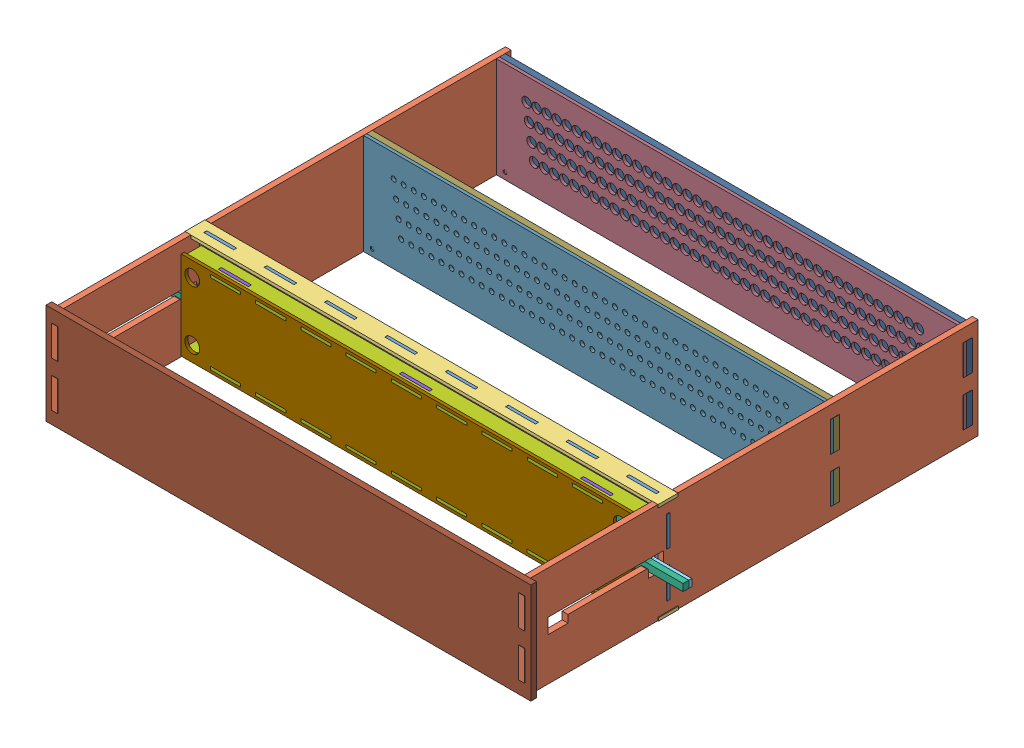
SolidWorks assembly Ensamblaje telar.SLDASM, configuration Predeterminado (file format 11000). Lengths in mm.
Overall size (527.2 100.2 451).
20 component instances, 15 part files, 57 mates.
Components (placement in the parent):
- placa principal-1: placa principal.SLDPRT [Predeterminado] at (25.0659 -19.802 468.9) size (470.4 100 3)
- pared-1: pared.SLDPRT [Predeterminado] at (-209.8341 -19.602 384.8) x (0 1 0) z (1 0 0) size (100 451 5.7)
- pared-2: pared.SLDPRT [Predeterminado] at (254.2659 -19.602 384.8) x (0 1 0) z (1 0 0) size (100 451 5.7)
- refuerzo placa principal-1: refuerzo placa principal.SLDPRT [Predeterminado] at (25.3659 -66.802 470.5) x (1 0 0) z (0 -1 0) size (470.4 20 3)
- refuerzo placa principal-2: refuerzo placa principal.SLDPRT [Predeterminado] at (24.7659 30.198 470.5) x (1 0 0) z (0 -1 0) size (470.4 20 3)
- 160 Seguros dos-1: 160 Seguros dos.SLDPRT [Predeterminado] at (249.0659 -63.802 472.5357) x (0 1 0) z (1 0 0) size (88 3 448)
- marco bloqueo inferior-2: marco bloqueo inferior.SLDPRT [Predeterminado] at (230.6659 -58.1922 475.5357) x (0 1 0) z (1 0 0) size (66.5 3 527.2)
- marco bloqueo superior-2: marco bloqueo superior.SLDPRT [Predeterminado] at (230.6659 -58.1922 478.5357) x (0 1 0) z (1 0 0) size (66.5 5.7 527.2)
- pared caja-1: pared caja.SLDPRT [Predeterminado] at (25.0659 -58.002 484.0357) x (1 0 0) z (0 -1 0) size (448 23 3)
- pared caja-2: pared caja.SLDPRT [Predeterminado] at (25.0659 21.398 484.0357) x (1 0 0) z (0 -1 0) size (448 23 3)
- deslizador-1: deslizador.SLDPRT [Predeterminado] at (-155.0341 -19.802 484.5357) size (36 82.4 3)
- deslizador-2: deslizador.SLDPRT [Predeterminado] at (24.9659 -19.802 484.5357) size (36 82.4 3)
- deslizador-3: deslizador.SLDPRT [Predeterminado] at (204.9659 -19.802 484.5357) size (36 82.4 3)
- tapa caja-1: tapa caja.SLDPRT [Predeterminado] at (25.0659 -19.802 492.5357) size (448 88 3) (hidden)
- base-1: base.SLDPRT [Predeterminado] at (25.0659 -19.602 168.3) size (470.4 100 5.7)
- tapa-1: tapa.SLDPRT [Predeterminado] at (25.1659 -19.602 607.3) size (482 100 5.7)
- guias-1: guias.SLDPRT [Predeterminado] at (25.0659 -19.602 300.4) size (470.4 100 5.7)
- guia inferior-1: guia inferior.SLDPRT [Predeterminado] at (25.0659 -19.602 174) size (470.4 100 3)
- guia superior-1: guia superior.SLDPRT [Predeterminado] at (25.0659 -19.602 306.1) size (470.4 100 3)
- Guia rodamientos-1: Guia rodamientos.SLDPRT [Predeterminado] at (-178.9341 -52.802 604.3) x (0 1 0) z (1 0 0) size (90 3 470.4)
Mates (geometry in assembly coordinates):
- Coincidente1: coincident: plane of placa principal-1 through (25.0659 -19.802 471.9) normal (0 0 1); plane of pared-1 through (-209.8351 -27.102 471.9) normal (0 0 -1)
- Coincidente2: coincident: plane of placa principal-1 through (-204.1341 -69.802 471.9) normal (-1 0 0); plane of pared-1 through (-204.1341 -19.602 384.8) normal (1 0 0)
- Coincidente3: coincident: plane of placa principal-1 through (-210.1341 -57.102 471.9) normal (0 -1 0); plane of pared-1 through (-209.8351 -57.102 471.9) normal (0 1 0)
- Coincidente4: coincident: plane of placa principal-1 through (254.2659 -69.802 471.9) normal (1 0 0); plane of pared-2 through (254.2659 -19.602 384.8) normal (-1 0 0)
- Coincidente5: coincident: plane of placa principal-1 through (25.0659 -19.802 471.9) normal (0 0 1); plane of pared-2 through (254.2649 -12.102 471.9) normal (0 0 -1)
- Coincidente6: coincident: plane of placa principal-1 through (260.2659 -57.102 471.9) normal (0 -1 0); plane of pared-2 through (254.2649 -57.102 471.9) normal (0 1 0)
- Coincidente7: coincident: plane of placa principal-1 through (25.0659 -19.802 471.9) normal (0 0 1); plane of refuerzo placa principal-1 through (-79.5341 -69.802 471.9) normal (0 0 -1)
- Coincidente9: coincident: plane of placa principal-1 through (25.0659 -66.802 468.9) normal (0 -1 0); plane of refuerzo placa principal-1 through (25.3659 -66.802 470.5) normal (0 1 0)
- Coincidente10: coincident: plane of placa principal-1 through (25.0659 -19.802 471.9) normal (0 0 1); plane of refuerzo placa principal-2 through (99.8659 27.198 471.9) normal (0 0 -1)
- Coincidente12: coincident: plane of placa principal-1 through (25.0659 27.198 468.9) normal (0 1 0); plane of refuerzo placa principal-2 through (24.7659 27.198 470.5) normal (0 -1 0)
- Concéntrica1: concentric: circle of placa principal-1; cylinder of 160 Seguros dos-1 through (-187.9341 9.198 475.5357) axis (0 0 -1) radius 7.4
- Concéntrica2: concentric: circle of placa principal-1; circle of 160 Seguros dos-1
- Concéntrica5: concentric: circle of placa principal-1; circle of 160 Seguros dos-1
- Coincidente13: coincident: plane of marco bloqueo inferior-2 through (-238.5341 -28.4422 478.5357) normal (-1 0 0); plane of marco bloqueo superior-2 through (-238.5341 -28.4422 484.2357) normal (-1 0 0)
- Coincidente14: coincident: plane of marco bloqueo inferior-2 through (223.3659 -56.3922 478.5357) normal (0 0 1); plane of marco bloqueo superior-2 through (223.3659 -56.3922 478.5357) normal (0 0 -1)
- Coincidente15: coincident: plane of marco bloqueo inferior-2 through (-198.5341 -28.4422 478.5357) normal (0 -1 0); plane of marco bloqueo superior-2 through (-198.5341 -28.4422 484.2357) normal (0 -1 0)
- Tangente1: tangent: circle of 160 Seguros dos-1; plane of marco bloqueo superior-2 through (-180.5341 -7.2922 484.2357) normal (-1 0 0)
- Tangente2: tangent: cylinder of 160 Seguros dos-1 through (238.0659 9.198 475.5357) axis (0 0 -1) radius 7.4; plane of marco bloqueo superior-2 through (230.6659 -7.2922 484.2357) normal (1 0 0)
- Coincidente16: coincident: plane of 160 Seguros dos-1 through (249.0659 -63.802 475.5357) normal (0 0 1); plane of marco bloqueo inferior-2 through (223.3659 -56.3922 475.5357) normal (0 0 -1)
- Coincidente18: coincident: plane of 160 Seguros dos-1 through (-198.9341 -63.802 475.5357) normal (-1 0 0); plane of pared caja-1 through (-198.9341 -61.002 475.5357) normal (-1 0 0)
- Coincidente19: coincident: plane of 160 Seguros dos-1 through (249.0659 -63.802 475.5357) normal (0 0 1); plane of pared caja-1 through (-198.9341 -61.002 475.5357) normal (0 0 -1)
- Coincidente21: coincident: plane of 160 Seguros dos-1 through (-198.9341 -63.802 475.5357) normal (-1 0 0); plane of pared caja-2 through (-198.9341 18.398 475.5357) normal (-1 0 0)
- Coincidente22: coincident: plane of 160 Seguros dos-1 through (249.0659 -63.802 475.5357) normal (0 0 1); plane of pared caja-2 through (-198.9341 18.398 475.5357) normal (0 0 -1)
- Coincidente23: coincident: plane of pared caja-1 through (25.0659 -58.002 484.0357) normal (0 1 0); plane of deslizador-1 through (-173.0341 -58.002 487.5357) normal (0 -1 0)
- Coincidente24: coincident: plane of pared caja-1 through (-140.0341 -61.003 484.5357) normal (-1 0 0); plane of deslizador-1 through (-140.0341 -61.002 487.5357) normal (1 0 0)
- Coincidente25: coincident: plane of pared caja-1 through (-140.0341 -61.003 484.5357) normal (0 0 1); plane of deslizador-1 through (-155.0341 -19.802 484.5357) normal (0 0 -1)
- Coincidente26: coincident: plane of pared caja-1 through (39.9659 -61.003 484.5357) normal (-1 0 0); plane of deslizador-2 through (39.9659 -61.002 487.5357) normal (1 0 0)
- Coincidente27: coincident: plane of pared caja-1 through (25.0659 -58.002 484.0357) normal (0 1 0); plane of deslizador-2 through (6.9659 -58.002 487.5357) normal (0 -1 0)
- Coincidente28: coincident: plane of pared caja-1 through (39.9659 -61.003 484.5357) normal (0 0 1); plane of deslizador-2 through (24.9659 -19.802 484.5357) normal (0 0 -1)
- Coincidente29: coincident: plane of pared caja-1 through (219.9659 -61.003 487.3357) normal (-1 0 0); plane of deslizador-3 through (219.9659 -61.002 487.5357) normal (1 0 0)
- Coincidente30: coincident: plane of pared caja-1 through (25.0659 -58.002 484.0357) normal (0 1 0); plane of deslizador-3 through (186.9659 -58.002 487.5357) normal (0 -1 0)
- Coincidente31: coincident: plane of pared caja-1 through (219.9659 -61.003 484.5357) normal (0 0 1); plane of deslizador-3 through (204.9659 -19.802 484.5357) normal (0 0 -1)
- Concéntrica6: concentric: circle of 160 Seguros dos-1; circle of tapa caja-1
- Concéntrica7: concentric: circle of 160 Seguros dos-1; circle of tapa caja-1
- Coincidente32: coincident: plane of pared caja-1 through (-198.9341 -61.002 492.5357) normal (0 0 1); plane of tapa caja-1 through (25.0659 -19.802 492.5357) normal (0 0 -1)
- Coincidente33: coincident: line of 160 Seguros dos-1 through (-5.0341 -58.002 475.5357) axis (-1 0 0); plane of pared caja-1 through (25.0659 -58.002 484.0357) normal (0 1 0)
- Coincidente34: coincident: plane of 160 Seguros dos-1 through (-50.0341 18.398 472.5347) normal (0 1 0); plane of pared caja-2 through (25.0659 18.398 484.0357) normal (0 -1 0)
- Coincidente35: coincident: plane of pared-1 through (-204.1341 -69.602 162.3) normal (0 -1 0); plane of base-1 through (-204.1341 -69.602 174) normal (0 -1 0)
- Coincidente36: coincident: plane of pared-1 through (-204.1341 -19.602 384.8) normal (1 0 0); plane of base-1 through (-204.1341 -69.602 174) normal (-1 0 0)
- Coincidente39: coincident: plane of pared-1 through (-204.1341 -69.602 162.3) normal (0 -1 0); plane of tapa-1 through (-215.8341 -69.602 613) normal (0 -1 0)
- Coincidente40: coincident: plane of pared-1 through (-204.1341 -19.602 384.8) normal (1 0 0); line of tapa-1 through (-204.1341 -57.002 607.3) axis (0 1 0)
- Coincidente41: coincident: plane of pared-1 through (-204.1341 -69.602 607.3) normal (0 0 1); plane of tapa-1 through (25.1659 -19.602 607.3) normal (0 0 -1)
- Coincidente42: coincident: plane of pared-1 through (-209.8351 -57.002 168.3) normal (0 0 1); plane of base-1 through (25.0659 -19.602 168.3) normal (0 0 -1)
- Coincidente43: coincident: plane of pared-1 through (-209.8351 -12.102 300.4) normal (0 0 1); plane of guias-1 through (25.0659 -19.602 300.4) normal (0 0 -1)
- Coincidente44: coincident: plane of pared-1 through (-204.1341 30.398 162.3) normal (0 1 0); plane of guias-1 through (-204.1341 30.398 306.1) normal (0 1 0)
- Coincidente45: coincident: plane of pared-1 through (-204.1341 -19.602 384.8) normal (1 0 0); plane of guias-1 through (-204.1341 -69.602 306.1) normal (-1 0 0)
- Coincidente46: coincident: plane of pared-1 through (-204.1341 -69.602 162.3) normal (0 -1 0); plane of guia inferior-1 through (-204.1341 -69.602 177) normal (0 -1 0)
- Coincidente47: coincident: plane of pared-1 through (-204.1341 -19.602 384.8) normal (1 0 0); plane of guia inferior-1 through (-204.1341 -69.602 177) normal (-1 0 0)
- Coincidente48: coincident: plane of base-1 through (25.0659 -19.602 174) normal (0 0 1); plane of guia inferior-1 through (25.0659 -19.602 174) normal (0 0 -1)
- Coincidente49: coincident: plane of pared-1 through (-204.1341 -69.602 162.3) normal (0 -1 0); plane of guia superior-1 through (-204.1341 -69.602 309.1) normal (0 -1 0)
- Coincidente50: coincident: plane of pared-1 through (-204.1341 -19.602 384.8) normal (1 0 0); plane of guia superior-1 through (-204.1341 -69.602 309.1) normal (-1 0 0)
- Coincidente51: coincident: plane of guias-1 through (25.0659 -19.602 306.1) normal (0 0 1); plane of guia superior-1 through (25.0659 -19.602 306.1) normal (0 0 -1)
- Coincidente52: coincident: plane of pared-1 through (-204.1341 -19.602 384.8) normal (1 0 0); plane of Guia rodamientos-1 through (-204.1341 -64.802 607.3) normal (-1 0 0)
- Concéntrica8: concentric: circle of tapa caja-1; cylinder of Guia rodamientos-1 through (-187.9341 -48.802 607.3) axis (0 0 -1) radius 3.9
- Coincidente53: coincident: plane of tapa-1 through (25.1659 -19.602 607.3) normal (0 0 -1); plane of Guia rodamientos-1 through (-178.9341 -52.802 607.3) normal (0 0 1)
- Coincidente54: coincident: plane of pared-1 through (-209.8341 -19.602 384.8) normal (-1 0 0); plane of refuerzo placa principal-1 through (-209.8341 -69.802 460.5) normal (-1 0 0)
- Coincidente55: coincident: plane of pared-2 through (259.9659 -19.602 384.8) normal (1 0 0); plane of refuerzo placa principal-2 through (259.9659 27.198 460.5) normal (1 0 0)
